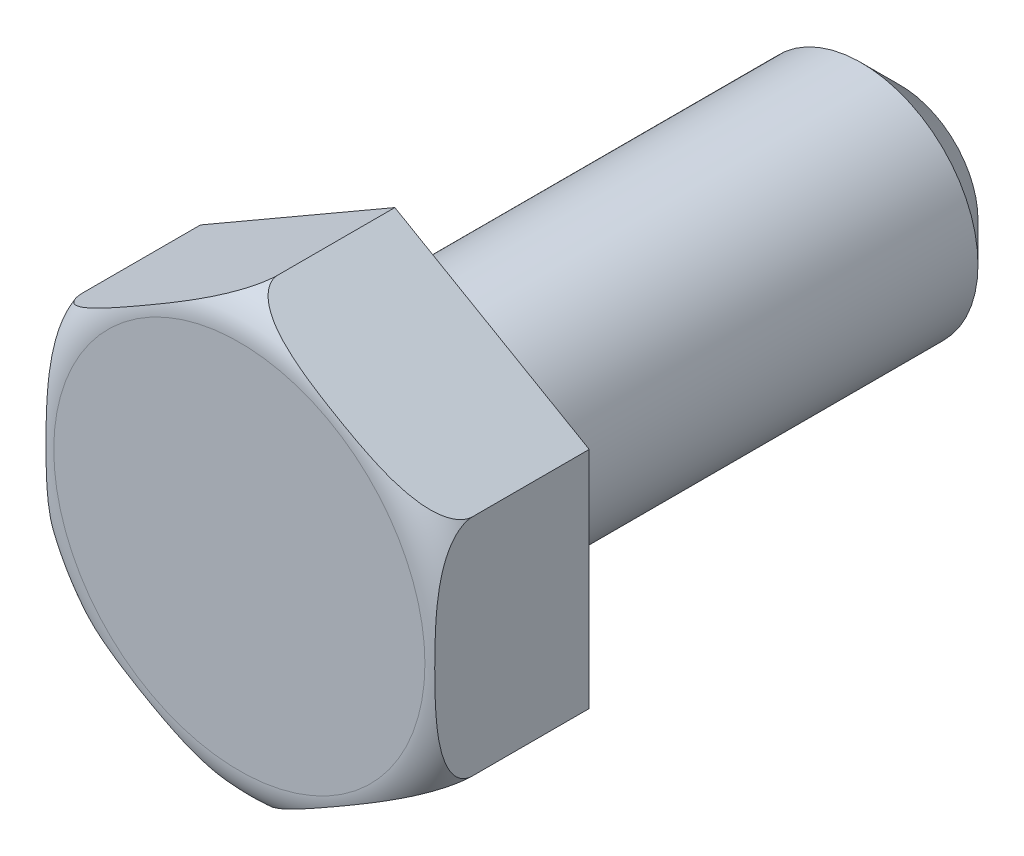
from build123d import *

# Parameters (mm, degrees)
HEAD_DEPTH         = 4
ESQUISSE1_R        = 3
BOSS_EXTRU_2_DEPTH = 13
CHANFREIN4_SIZE    = 1


with BuildPart() as part:
    # Head Sketch → Head (new body)
    with BuildSketch(Plane.XY):
        Polygon((0, 5.773502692), (5, 2.886751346), (5, -2.886751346), (0, -5.773502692), (-5, -2.886751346), (-5, 2.886751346), align=None)
    extrude(amount=HEAD_DEPTH)

    # Sketch5 → Head Trim (revolve, cut)
    with BuildSketch(Plane(origin=(0, 0, 0), x_dir=(0, 0, -1), z_dir=(1, 0, 0)), mode=Mode.PRIVATE) as head_trim_sk:
        with BuildLine():
            Line((-4, -4.773502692), (-4, -5.773502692))
            Line((-4, -5.773502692), (-3, -5.773502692))
            ThreePointArc((-3, -5.773502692), (-3.707106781, -5.480609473), (-4, -4.773502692))
        make_face()
    revolve(head_trim_sk.sketch.rotate(Axis((0, 0, 15.085599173), (0, 0, -1)), 270), axis=Axis((0, 0, 15.085599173), (0, 0, -1)), mode=Mode.SUBTRACT)

    # Esquisse1 → Boss.-Extru.2 (add)
    with BuildSketch(Plane(origin=(0, 0, 0), x_dir=(-1, 0, 0), z_dir=(0, 0, -1))):
        with Locations(Location((0, 0, 0), (0, 0, 180))):
            Circle(ESQUISSE1_R)
    extrude(amount=BOSS_EXTRU_2_DEPTH)

    # Chanfrein4
    chanfrein4_edges = [part.edges().sort_by_distance(p)[0] for p in [
        (-3, 0, -13),
    ]]
    chamfer(chanfrein4_edges, length=CHANFREIN4_SIZE)


solid = part.part
